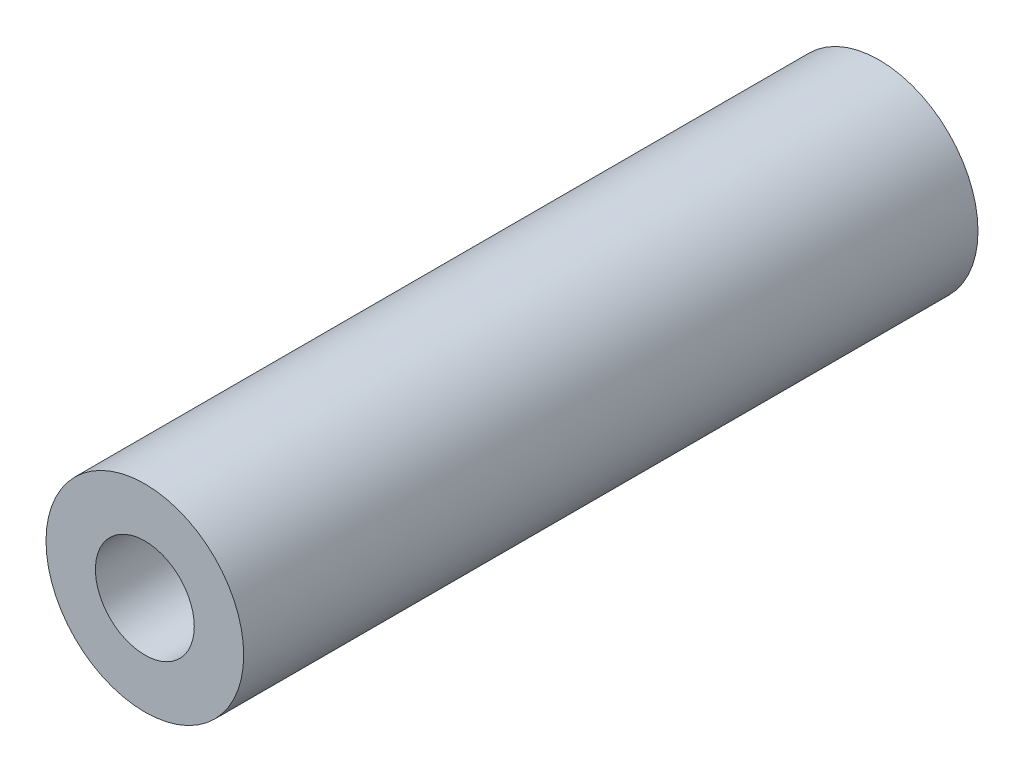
ISO-10303-21;
HEADER;
FILE_DESCRIPTION(('STEP AP214'),'2;1');
FILE_NAME('part.step','',(''),(''),'','','');
FILE_SCHEMA(('AUTOMOTIVE_DESIGN { 1 0 10303 214 1 1 1 1 }'));
ENDSEC;
DATA;
#1=APPLICATION_CONTEXT('core data for automotive mechanical design processes');
#2=APPLICATION_PROTOCOL_DEFINITION('international standard','automotive_design',2000,#1);
#3=PRODUCT_CONTEXT('',#1,'mechanical');
#4=PRODUCT('Part','Part','',(#3));
#5=PRODUCT_RELATED_PRODUCT_CATEGORY('part','',(#4));
#6=PRODUCT_DEFINITION_FORMATION('','',#4);
#7=PRODUCT_DEFINITION_CONTEXT('part definition',#1,'design');
#8=PRODUCT_DEFINITION('design','',#6,#7);
#9=PRODUCT_DEFINITION_SHAPE('','',#8);
#10=(LENGTH_UNIT() NAMED_UNIT(*) SI_UNIT(.MILLI.,.METRE.));
#11=(NAMED_UNIT(*) PLANE_ANGLE_UNIT() SI_UNIT($,.RADIAN.));
#12=(NAMED_UNIT(*) SI_UNIT($,.STERADIAN.) SOLID_ANGLE_UNIT());
#13=UNCERTAINTY_MEASURE_WITH_UNIT(LENGTH_MEASURE(1.E-05),#10,'distance_accuracy_value','');
#14=(GEOMETRIC_REPRESENTATION_CONTEXT(3) GLOBAL_UNCERTAINTY_ASSIGNED_CONTEXT((#13)) GLOBAL_UNIT_ASSIGNED_CONTEXT((#10,
#11,#12)) REPRESENTATION_CONTEXT('',''));
#15=CARTESIAN_POINT('',(0.,0.,0.));
#16=DIRECTION('',(0.,0.,1.));
#17=DIRECTION('',(1.,0.,0.));
#18=AXIS2_PLACEMENT_3D('',#15,#16,#17);
#19=CARTESIAN_POINT('',(0.,0.,-26.));
#20=DIRECTION('',(0.,0.,1.));
#21=DIRECTION('',(1.,0.,0.));
#22=AXIS2_PLACEMENT_3D('',#19,#20,#21);
#23=CYLINDRICAL_SURFACE('',#22,3.5);
#24=CARTESIAN_POINT('',(0.,0.,-26.));
#25=DIRECTION('',(0.,0.,1.));
#26=DIRECTION('',(1.,0.,0.));
#27=AXIS2_PLACEMENT_3D('',#24,#25,#26);
#28=CIRCLE('',#27,3.5);
#29=CARTESIAN_POINT('',(3.5,0.,-26.));
#30=VERTEX_POINT('',#29);
#31=EDGE_CURVE('E10',#30,#30,#28,.T.);
#32=CARTESIAN_POINT('',(0.,0.,0.));
#33=DIRECTION('',(0.,0.,1.));
#34=DIRECTION('',(1.,0.,0.));
#35=AXIS2_PLACEMENT_3D('',#32,#33,#34);
#36=CIRCLE('',#35,3.5);
#37=CARTESIAN_POINT('',(3.5,0.,0.));
#38=VERTEX_POINT('',#37);
#39=EDGE_CURVE('E30',#38,#38,#36,.T.);
#40=CARTESIAN_POINT('',(3.5,0.,-26.));
#41=CARTESIAN_POINT('',(3.5,0.,-25.7291666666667));
#42=CARTESIAN_POINT('',(3.5,0.,-25.4583333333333));
#43=CARTESIAN_POINT('',(3.5,0.,-24.9166666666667));
#44=CARTESIAN_POINT('',(3.5,0.,-24.6458333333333));
#45=CARTESIAN_POINT('',(3.5,0.,-24.1041666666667));
#46=CARTESIAN_POINT('',(3.5,0.,-23.8333333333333));
#47=CARTESIAN_POINT('',(3.5,0.,-23.2916666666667));
#48=CARTESIAN_POINT('',(3.5,0.,-23.0208333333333));
#49=CARTESIAN_POINT('',(3.5,0.,-22.4791666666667));
#50=CARTESIAN_POINT('',(3.5,0.,-22.2083333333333));
#51=CARTESIAN_POINT('',(3.5,0.,-21.6666666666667));
#52=CARTESIAN_POINT('',(3.5,0.,-21.3958333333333));
#53=CARTESIAN_POINT('',(3.5,0.,-20.8541666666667));
#54=CARTESIAN_POINT('',(3.5,0.,-20.5833333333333));
#55=CARTESIAN_POINT('',(3.5,0.,-20.0416666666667));
#56=CARTESIAN_POINT('',(3.5,0.,-19.7708333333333));
#57=CARTESIAN_POINT('',(3.5,0.,-19.2291666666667));
#58=CARTESIAN_POINT('',(3.5,0.,-18.9583333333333));
#59=CARTESIAN_POINT('',(3.5,0.,-18.4166666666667));
#60=CARTESIAN_POINT('',(3.5,0.,-18.1458333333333));
#61=CARTESIAN_POINT('',(3.5,0.,-17.6041666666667));
#62=CARTESIAN_POINT('',(3.5,0.,-17.3333333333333));
#63=CARTESIAN_POINT('',(3.5,0.,-16.7916666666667));
#64=CARTESIAN_POINT('',(3.5,0.,-16.5208333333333));
#65=CARTESIAN_POINT('',(3.5,0.,-15.9791666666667));
#66=CARTESIAN_POINT('',(3.5,0.,-15.7083333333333));
#67=CARTESIAN_POINT('',(3.5,0.,-15.1666666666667));
#68=CARTESIAN_POINT('',(3.5,0.,-14.8958333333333));
#69=CARTESIAN_POINT('',(3.5,0.,-14.3541666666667));
#70=CARTESIAN_POINT('',(3.5,0.,-14.0833333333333));
#71=CARTESIAN_POINT('',(3.5,0.,-13.5416666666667));
#72=CARTESIAN_POINT('',(3.5,0.,-13.2708333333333));
#73=CARTESIAN_POINT('',(3.5,0.,-12.7291666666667));
#74=CARTESIAN_POINT('',(3.5,0.,-12.4583333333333));
#75=CARTESIAN_POINT('',(3.5,0.,-11.9166666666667));
#76=CARTESIAN_POINT('',(3.5,0.,-11.6458333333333));
#77=CARTESIAN_POINT('',(3.5,0.,-11.1041666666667));
#78=CARTESIAN_POINT('',(3.5,0.,-10.8333333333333));
#79=CARTESIAN_POINT('',(3.5,0.,-10.2916666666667));
#80=CARTESIAN_POINT('',(3.5,0.,-10.0208333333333));
#81=CARTESIAN_POINT('',(3.5,0.,-9.47916666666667));
#82=CARTESIAN_POINT('',(3.5,0.,-9.20833333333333));
#83=CARTESIAN_POINT('',(3.5,0.,-8.66666666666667));
#84=CARTESIAN_POINT('',(3.5,0.,-8.39583333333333));
#85=CARTESIAN_POINT('',(3.5,0.,-7.85416666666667));
#86=CARTESIAN_POINT('',(3.5,0.,-7.58333333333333));
#87=CARTESIAN_POINT('',(3.5,0.,-7.04166666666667));
#88=CARTESIAN_POINT('',(3.5,0.,-6.77083333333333));
#89=CARTESIAN_POINT('',(3.5,0.,-6.22916666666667));
#90=CARTESIAN_POINT('',(3.5,0.,-5.95833333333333));
#91=CARTESIAN_POINT('',(3.5,0.,-5.41666666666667));
#92=CARTESIAN_POINT('',(3.5,0.,-5.14583333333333));
#93=CARTESIAN_POINT('',(3.5,0.,-4.60416666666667));
#94=CARTESIAN_POINT('',(3.5,0.,-4.33333333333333));
#95=CARTESIAN_POINT('',(3.5,0.,-3.79166666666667));
#96=CARTESIAN_POINT('',(3.5,0.,-3.52083333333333));
#97=CARTESIAN_POINT('',(3.5,0.,-2.97916666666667));
#98=CARTESIAN_POINT('',(3.5,0.,-2.70833333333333));
#99=CARTESIAN_POINT('',(3.5,0.,-2.16666666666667));
#100=CARTESIAN_POINT('',(3.5,0.,-1.89583333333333));
#101=CARTESIAN_POINT('',(3.5,0.,-1.35416666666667));
#102=CARTESIAN_POINT('',(3.5,0.,-1.08333333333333));
#103=CARTESIAN_POINT('',(3.5,0.,-0.541666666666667));
#104=CARTESIAN_POINT('',(3.5,0.,-0.270833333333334));
#105=CARTESIAN_POINT('',(3.5,0.,0.));
#106=B_SPLINE_CURVE_WITH_KNOTS('',3,(#40,#41,#42,#43,#44,#45,#46,#47,#48,#49,#50,#51,#52,#53,
#54,#55,#56,#57,#58,#59,#60,#61,#62,#63,#64,#65,#66,#67,#68,#69,#70,#71,#72,#73,#74,#75,#76,#77,
#78,#79,#80,#81,#82,#83,#84,#85,#86,#87,#88,#89,#90,#91,#92,#93,#94,#95,#96,#97,#98,#99,#100,
#101,#102,#103,#104,#105),.UNSPECIFIED.,.F.,.F.,(4,2,2,2,2,2,2,2,2,2,2,2,2,2,2,2,2,2,2,2,2,2,2,
2,2,2,2,2,2,2,2,2,4),(0.,0.812499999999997,1.625,2.4375,3.25,4.0625,4.875,5.6875,6.5,7.3125,
8.125,8.9375,9.75,10.5625,11.375,12.1875,13.,13.8125,14.625,15.4375,16.25,17.0625,17.875,
18.6875,19.5,20.3125,21.125,21.9375,22.75,23.5625,24.375,25.1875,26.),.UNSPECIFIED.);
#107=EDGE_CURVE('BSEAM24',#30,#38,#106,.T.);
#108=ORIENTED_EDGE('',*,*,#31,.T.);
#109=ORIENTED_EDGE('',*,*,#39,.F.);
#110=ORIENTED_EDGE('',*,*,#107,.T.);
#111=ORIENTED_EDGE('',*,*,#107,.F.);
#112=EDGE_LOOP('',(#108,#110,#109,#111));
#113=FACE_BOUND('',#112,.T.);
#114=ADVANCED_FACE('F24',(#113),#23,.T.);
#115=CARTESIAN_POINT('',(0.,0.,-26.));
#116=DIRECTION('',(0.,0.,1.));
#117=DIRECTION('',(1.,0.,0.));
#118=AXIS2_PLACEMENT_3D('',#115,#116,#117);
#119=PLANE('',#118);
#120=CARTESIAN_POINT('',(0.,0.,-26.));
#121=DIRECTION('',(0.,0.,1.));
#122=DIRECTION('',(1.,0.,0.));
#123=AXIS2_PLACEMENT_3D('',#120,#121,#122);
#124=CIRCLE('',#123,1.75);
#125=CARTESIAN_POINT('',(1.75,0.,-26.));
#126=VERTEX_POINT('',#125);
#127=EDGE_CURVE('E34',#126,#126,#124,.T.);
#128=ORIENTED_EDGE('',*,*,#127,.T.);
#129=EDGE_LOOP('',(#128));
#130=FACE_BOUND('',#129,.T.);
#131=ORIENTED_EDGE('',*,*,#31,.F.);
#132=EDGE_LOOP('',(#131));
#133=FACE_BOUND('',#132,.T.);
#134=ADVANCED_FACE('F48',(#130,#133),#119,.F.);
#135=CARTESIAN_POINT('',(0.,0.,0.));
#136=DIRECTION('',(0.,0.,1.));
#137=DIRECTION('',(1.,0.,0.));
#138=AXIS2_PLACEMENT_3D('',#135,#136,#137);
#139=PLANE('',#138);
#140=CARTESIAN_POINT('',(0.,0.,0.));
#141=DIRECTION('',(0.,0.,1.));
#142=DIRECTION('',(1.,0.,0.));
#143=AXIS2_PLACEMENT_3D('',#140,#141,#142);
#144=CIRCLE('',#143,1.75);
#145=CARTESIAN_POINT('',(1.75,0.,0.));
#146=VERTEX_POINT('',#145);
#147=EDGE_CURVE('E38',#146,#146,#144,.T.);
#148=ORIENTED_EDGE('',*,*,#147,.F.);
#149=EDGE_LOOP('',(#148));
#150=FACE_BOUND('',#149,.T.);
#151=ORIENTED_EDGE('',*,*,#39,.T.);
#152=EDGE_LOOP('',(#151));
#153=FACE_BOUND('',#152,.T.);
#154=ADVANCED_FACE('F46',(#150,#153),#139,.T.);
#155=CARTESIAN_POINT('',(0.,0.,-26.));
#156=DIRECTION('',(0.,0.,1.));
#157=DIRECTION('',(1.,0.,0.));
#158=AXIS2_PLACEMENT_3D('',#155,#156,#157);
#159=CYLINDRICAL_SURFACE('',#158,1.75);
#160=CARTESIAN_POINT('',(1.75,0.,-26.));
#161=CARTESIAN_POINT('',(1.75,0.,-25.7291666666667));
#162=CARTESIAN_POINT('',(1.75,0.,-25.4583333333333));
#163=CARTESIAN_POINT('',(1.75,0.,-24.9166666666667));
#164=CARTESIAN_POINT('',(1.75,0.,-24.6458333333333));
#165=CARTESIAN_POINT('',(1.75,0.,-24.1041666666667));
#166=CARTESIAN_POINT('',(1.75,0.,-23.8333333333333));
#167=CARTESIAN_POINT('',(1.75,0.,-23.2916666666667));
#168=CARTESIAN_POINT('',(1.75,0.,-23.0208333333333));
#169=CARTESIAN_POINT('',(1.75,0.,-22.4791666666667));
#170=CARTESIAN_POINT('',(1.75,0.,-22.2083333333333));
#171=CARTESIAN_POINT('',(1.75,0.,-21.6666666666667));
#172=CARTESIAN_POINT('',(1.75,0.,-21.3958333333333));
#173=CARTESIAN_POINT('',(1.75,0.,-20.8541666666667));
#174=CARTESIAN_POINT('',(1.75,0.,-20.5833333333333));
#175=CARTESIAN_POINT('',(1.75,0.,-20.0416666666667));
#176=CARTESIAN_POINT('',(1.75,0.,-19.7708333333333));
#177=CARTESIAN_POINT('',(1.75,0.,-19.2291666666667));
#178=CARTESIAN_POINT('',(1.75,0.,-18.9583333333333));
#179=CARTESIAN_POINT('',(1.75,0.,-18.4166666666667));
#180=CARTESIAN_POINT('',(1.75,0.,-18.1458333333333));
#181=CARTESIAN_POINT('',(1.75,0.,-17.6041666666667));
#182=CARTESIAN_POINT('',(1.75,0.,-17.3333333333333));
#183=CARTESIAN_POINT('',(1.75,0.,-16.7916666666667));
#184=CARTESIAN_POINT('',(1.75,0.,-16.5208333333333));
#185=CARTESIAN_POINT('',(1.75,0.,-15.9791666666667));
#186=CARTESIAN_POINT('',(1.75,0.,-15.7083333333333));
#187=CARTESIAN_POINT('',(1.75,0.,-15.1666666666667));
#188=CARTESIAN_POINT('',(1.75,0.,-14.8958333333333));
#189=CARTESIAN_POINT('',(1.75,0.,-14.3541666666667));
#190=CARTESIAN_POINT('',(1.75,0.,-14.0833333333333));
#191=CARTESIAN_POINT('',(1.75,0.,-13.5416666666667));
#192=CARTESIAN_POINT('',(1.75,0.,-13.2708333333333));
#193=CARTESIAN_POINT('',(1.75,0.,-12.7291666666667));
#194=CARTESIAN_POINT('',(1.75,0.,-12.4583333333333));
#195=CARTESIAN_POINT('',(1.75,0.,-11.9166666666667));
#196=CARTESIAN_POINT('',(1.75,0.,-11.6458333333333));
#197=CARTESIAN_POINT('',(1.75,0.,-11.1041666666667));
#198=CARTESIAN_POINT('',(1.75,0.,-10.8333333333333));
#199=CARTESIAN_POINT('',(1.75,0.,-10.2916666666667));
#200=CARTESIAN_POINT('',(1.75,0.,-10.0208333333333));
#201=CARTESIAN_POINT('',(1.75,0.,-9.47916666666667));
#202=CARTESIAN_POINT('',(1.75,0.,-9.20833333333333));
#203=CARTESIAN_POINT('',(1.75,0.,-8.66666666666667));
#204=CARTESIAN_POINT('',(1.75,0.,-8.39583333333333));
#205=CARTESIAN_POINT('',(1.75,0.,-7.85416666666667));
#206=CARTESIAN_POINT('',(1.75,0.,-7.58333333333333));
#207=CARTESIAN_POINT('',(1.75,0.,-7.04166666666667));
#208=CARTESIAN_POINT('',(1.75,0.,-6.77083333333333));
#209=CARTESIAN_POINT('',(1.75,0.,-6.22916666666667));
#210=CARTESIAN_POINT('',(1.75,0.,-5.95833333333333));
#211=CARTESIAN_POINT('',(1.75,0.,-5.41666666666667));
#212=CARTESIAN_POINT('',(1.75,0.,-5.14583333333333));
#213=CARTESIAN_POINT('',(1.75,0.,-4.60416666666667));
#214=CARTESIAN_POINT('',(1.75,0.,-4.33333333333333));
#215=CARTESIAN_POINT('',(1.75,0.,-3.79166666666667));
#216=CARTESIAN_POINT('',(1.75,0.,-3.52083333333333));
#217=CARTESIAN_POINT('',(1.75,0.,-2.97916666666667));
#218=CARTESIAN_POINT('',(1.75,0.,-2.70833333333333));
#219=CARTESIAN_POINT('',(1.75,0.,-2.16666666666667));
#220=CARTESIAN_POINT('',(1.75,0.,-1.89583333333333));
#221=CARTESIAN_POINT('',(1.75,0.,-1.35416666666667));
#222=CARTESIAN_POINT('',(1.75,0.,-1.08333333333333));
#223=CARTESIAN_POINT('',(1.75,0.,-0.541666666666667));
#224=CARTESIAN_POINT('',(1.75,0.,-0.270833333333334));
#225=CARTESIAN_POINT('',(1.75,0.,0.));
#226=B_SPLINE_CURVE_WITH_KNOTS('',3,(#160,#161,#162,#163,#164,#165,#166,#167,#168,#169,#170,
#171,#172,#173,#174,#175,#176,#177,#178,#179,#180,#181,#182,#183,#184,#185,#186,#187,#188,#189,
#190,#191,#192,#193,#194,#195,#196,#197,#198,#199,#200,#201,#202,#203,#204,#205,#206,#207,#208,
#209,#210,#211,#212,#213,#214,#215,#216,#217,#218,#219,#220,#221,#222,#223,#224,#225),
.UNSPECIFIED.,.F.,.F.,(4,2,2,2,2,2,2,2,2,2,2,2,2,2,2,2,2,2,2,2,2,2,2,2,2,2,2,2,2,2,2,2,4),(0.,
0.812499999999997,1.625,2.4375,3.25,4.0625,4.875,5.6875,6.5,7.3125,8.125,8.9375,9.75,10.5625,
11.375,12.1875,13.,13.8125,14.625,15.4375,16.25,17.0625,17.875,18.6875,19.5,20.3125,21.125,
21.9375,22.75,23.5625,24.375,25.1875,26.),.UNSPECIFIED.);
#227=EDGE_CURVE('BSEAM44',#126,#146,#226,.T.);
#228=ORIENTED_EDGE('',*,*,#127,.F.);
#229=ORIENTED_EDGE('',*,*,#147,.T.);
#230=ORIENTED_EDGE('',*,*,#227,.T.);
#231=ORIENTED_EDGE('',*,*,#227,.F.);
#232=EDGE_LOOP('',(#228,#230,#229,#231));
#233=FACE_BOUND('',#232,.T.);
#234=ADVANCED_FACE('F44',(#233),#159,.F.);
#235=CLOSED_SHELL('',(#114,#134,#154,#234));
#236=MANIFOLD_SOLID_BREP('B2',#235);
#237=ADVANCED_BREP_SHAPE_REPRESENTATION('',(#18,#236),#14);
#238=SHAPE_DEFINITION_REPRESENTATION(#9,#237);
ENDSEC;
END-ISO-10303-21;
